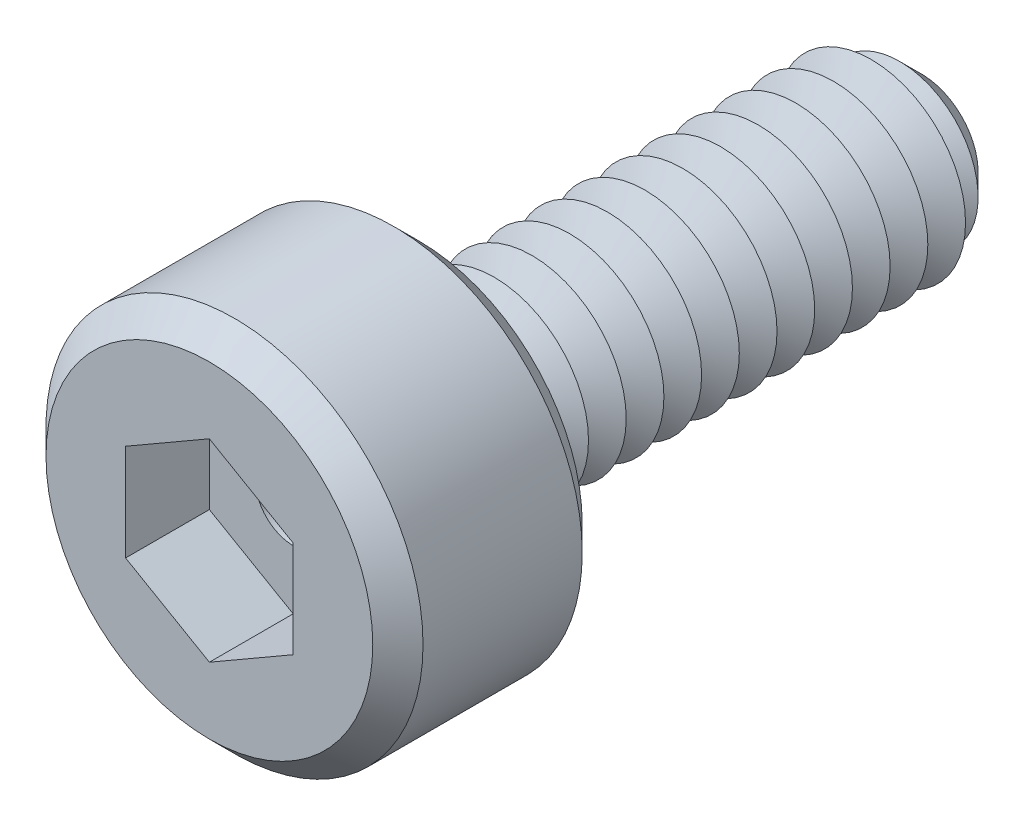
ISO-10303-21;
HEADER;
FILE_DESCRIPTION(('STEP AP214'),'2;1');
FILE_NAME('part.step','',(''),(''),'','','');
FILE_SCHEMA(('AUTOMOTIVE_DESIGN { 1 0 10303 214 1 1 1 1 }'));
ENDSEC;
DATA;
#1=APPLICATION_CONTEXT('core data for automotive mechanical design processes');
#2=APPLICATION_PROTOCOL_DEFINITION('international standard','automotive_design',2000,#1);
#3=PRODUCT_CONTEXT('',#1,'mechanical');
#4=PRODUCT('Part','Part','',(#3));
#5=PRODUCT_RELATED_PRODUCT_CATEGORY('part','',(#4));
#6=PRODUCT_DEFINITION_FORMATION('','',#4);
#7=PRODUCT_DEFINITION_CONTEXT('part definition',#1,'design');
#8=PRODUCT_DEFINITION('design','',#6,#7);
#9=PRODUCT_DEFINITION_SHAPE('','',#8);
#10=(LENGTH_UNIT() NAMED_UNIT(*) SI_UNIT(.MILLI.,.METRE.));
#11=(NAMED_UNIT(*) PLANE_ANGLE_UNIT() SI_UNIT($,.RADIAN.));
#12=(NAMED_UNIT(*) SI_UNIT($,.STERADIAN.) SOLID_ANGLE_UNIT());
#13=UNCERTAINTY_MEASURE_WITH_UNIT(LENGTH_MEASURE(1.E-05),#10,'distance_accuracy_value','');
#14=(GEOMETRIC_REPRESENTATION_CONTEXT(3) GLOBAL_UNCERTAINTY_ASSIGNED_CONTEXT((#13)) GLOBAL_UNIT_ASSIGNED_CONTEXT((#10,
#11,#12)) REPRESENTATION_CONTEXT('',''));
#15=CARTESIAN_POINT('',(0.,0.,0.));
#16=DIRECTION('',(0.,0.,1.));
#17=DIRECTION('',(1.,0.,0.));
#18=AXIS2_PLACEMENT_3D('',#15,#16,#17);
#19=CARTESIAN_POINT('',(0.,0.,2.5));
#20=DIRECTION('',(0.,0.,-1.));
#21=DIRECTION('',(-1.,0.,0.));
#22=AXIS2_PLACEMENT_3D('',#19,#20,#21);
#23=CYLINDRICAL_SURFACE('',#22,2.25);
#24=CARTESIAN_POINT('',(0.,0.,0.300000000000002));
#25=DIRECTION('',(0.,0.,1.));
#26=DIRECTION('',(1.,0.,0.));
#27=AXIS2_PLACEMENT_3D('',#24,#25,#26);
#28=CIRCLE('',#27,2.25);
#29=CARTESIAN_POINT('',(2.25,0.,0.300000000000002));
#30=VERTEX_POINT('',#29);
#31=EDGE_CURVE('E281',#30,#30,#28,.T.);
#32=ORIENTED_EDGE('',*,*,#31,.T.);
#33=EDGE_LOOP('',(#32));
#34=FACE_BOUND('',#33,.T.);
#35=CARTESIAN_POINT('',(0.,0.,2.2));
#36=DIRECTION('',(0.,0.,1.));
#37=DIRECTION('',(1.,0.,0.));
#38=AXIS2_PLACEMENT_3D('',#35,#36,#37);
#39=CIRCLE('',#38,2.25);
#40=CARTESIAN_POINT('',(2.25,0.,2.2));
#41=VERTEX_POINT('',#40);
#42=EDGE_CURVE('E274',#41,#41,#39,.F.);
#43=ORIENTED_EDGE('',*,*,#42,.T.);
#44=EDGE_LOOP('',(#43));
#45=FACE_BOUND('',#44,.T.);
#46=ADVANCED_FACE('F39',(#34,#45),#23,.T.);
#47=CARTESIAN_POINT('',(0.,0.,2.5));
#48=DIRECTION('',(0.,0.,1.));
#49=DIRECTION('',(1.,0.,0.));
#50=AXIS2_PLACEMENT_3D('',#47,#48,#49);
#51=PLANE('',#50);
#52=CARTESIAN_POINT('',(0.,0.,2.5));
#53=DIRECTION('',(0.,0.,1.));
#54=DIRECTION('',(1.,0.,0.));
#55=AXIS2_PLACEMENT_3D('',#52,#53,#54);
#56=CIRCLE('',#55,1.95);
#57=CARTESIAN_POINT('',(1.95,0.,2.5));
#58=VERTEX_POINT('',#57);
#59=EDGE_CURVE('E11',#58,#58,#56,.T.);
#60=ORIENTED_EDGE('',*,*,#59,.T.);
#61=EDGE_LOOP('',(#60));
#62=FACE_BOUND('',#61,.T.);
#63=DIRECTION('',(-0.866025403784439,0.5,0.));
#64=VECTOR('',#63,1.);
#65=CARTESIAN_POINT('',(0.999999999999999,0.577350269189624,2.5));
#66=LINE('',#65,#64);
#67=CARTESIAN_POINT('',(0.999999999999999,0.577350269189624,2.5));
#68=VERTEX_POINT('',#67);
#69=CARTESIAN_POINT('',(0.,1.15470053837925,2.5));
#70=VERTEX_POINT('',#69);
#71=EDGE_CURVE('E55',#68,#70,#66,.T.);
#72=ORIENTED_EDGE('',*,*,#71,.F.);
#73=DIRECTION('',(0.,1.,0.));
#74=VECTOR('',#73,1.);
#75=CARTESIAN_POINT('',(1.,-0.577350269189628,2.5));
#76=LINE('',#75,#74);
#77=CARTESIAN_POINT('',(1.,-0.577350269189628,2.5));
#78=VERTEX_POINT('',#77);
#79=EDGE_CURVE('E151',#78,#68,#76,.T.);
#80=ORIENTED_EDGE('',*,*,#79,.F.);
#81=DIRECTION('',(0.866025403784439,0.5,0.));
#82=VECTOR('',#81,1.);
#83=CARTESIAN_POINT('',(0.,-1.15470053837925,2.5));
#84=LINE('',#83,#82);
#85=CARTESIAN_POINT('',(0.,-1.15470053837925,2.5));
#86=VERTEX_POINT('',#85);
#87=EDGE_CURVE('E148',#86,#78,#84,.T.);
#88=ORIENTED_EDGE('',*,*,#87,.F.);
#89=DIRECTION('',(0.866025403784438,-0.5,0.));
#90=VECTOR('',#89,1.);
#91=CARTESIAN_POINT('',(-1.,-0.577350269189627,2.5));
#92=LINE('',#91,#90);
#93=CARTESIAN_POINT('',(-1.,-0.577350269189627,2.5));
#94=VERTEX_POINT('',#93);
#95=EDGE_CURVE('E103',#94,#86,#92,.T.);
#96=ORIENTED_EDGE('',*,*,#95,.F.);
#97=DIRECTION('',(0.,-1.,0.));
#98=VECTOR('',#97,1.);
#99=CARTESIAN_POINT('',(-1.,0.577350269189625,2.5));
#100=LINE('',#99,#98);
#101=CARTESIAN_POINT('',(-1.,0.577350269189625,2.5));
#102=VERTEX_POINT('',#101);
#103=EDGE_CURVE('E142',#102,#94,#100,.T.);
#104=ORIENTED_EDGE('',*,*,#103,.F.);
#105=DIRECTION('',(-0.866025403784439,-0.5,0.));
#106=VECTOR('',#105,1.);
#107=CARTESIAN_POINT('',(0.,1.15470053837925,2.5));
#108=LINE('',#107,#106);
#109=EDGE_CURVE('E137',#70,#102,#108,.T.);
#110=ORIENTED_EDGE('',*,*,#109,.F.);
#111=EDGE_LOOP('',(#72,#80,#88,#96,#104,#110));
#112=FACE_BOUND('',#111,.T.);
#113=ADVANCED_FACE('F298',(#62,#112),#51,.T.);
#114=CARTESIAN_POINT('',(0.,0.,0.));
#115=DIRECTION('',(0.,0.,1.));
#116=DIRECTION('',(1.,0.,0.));
#117=AXIS2_PLACEMENT_3D('',#114,#115,#116);
#118=PLANE('',#117);
#119=CARTESIAN_POINT('',(0.,0.,0.));
#120=DIRECTION('',(0.,0.,1.));
#121=DIRECTION('',(1.,0.,0.));
#122=AXIS2_PLACEMENT_3D('',#119,#120,#121);
#123=CIRCLE('',#122,1.95);
#124=CARTESIAN_POINT('',(1.95,0.,0.));
#125=VERTEX_POINT('',#124);
#126=EDGE_CURVE('E48',#125,#125,#123,.F.);
#127=ORIENTED_EDGE('',*,*,#126,.T.);
#128=EDGE_LOOP('',(#127));
#129=FACE_BOUND('',#128,.T.);
#130=CARTESIAN_POINT('',(0.,0.,0.));
#131=DIRECTION('',(0.,0.,1.));
#132=DIRECTION('',(1.,0.,0.));
#133=AXIS2_PLACEMENT_3D('',#130,#131,#132);
#134=CIRCLE('',#133,1.125);
#135=CARTESIAN_POINT('',(1.125,0.,0.));
#136=VERTEX_POINT('',#135);
#137=EDGE_CURVE('E266',#136,#136,#134,.T.);
#138=ORIENTED_EDGE('',*,*,#137,.T.);
#139=EDGE_LOOP('',(#138));
#140=FACE_BOUND('',#139,.T.);
#141=ADVANCED_FACE('F287',(#129,#140),#118,.F.);
#142=CARTESIAN_POINT('',(0.,0.,0.));
#143=DIRECTION('',(0.,0.,1.));
#144=DIRECTION('',(1.,0.,0.));
#145=AXIS2_PLACEMENT_3D('',#142,#143,#144);
#146=CONICAL_SURFACE('',#145,1.125,1.0471975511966);
#147=CARTESIAN_POINT('',(0.,0.,-0.225));
#148=DIRECTION('',(0.,0.,1.));
#149=DIRECTION('',(1.,0.,0.));
#150=AXIS2_PLACEMENT_3D('',#147,#148,#149);
#151=CIRCLE('',#150,0.735288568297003);
#152=CARTESIAN_POINT('',(0.735288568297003,0.,-0.225));
#153=VERTEX_POINT('',#152);
#154=EDGE_CURVE('E262',#153,#153,#151,.T.);
#155=ORIENTED_EDGE('',*,*,#154,.T.);
#156=EDGE_LOOP('',(#155));
#157=FACE_BOUND('',#156,.T.);
#158=ORIENTED_EDGE('',*,*,#137,.F.);
#159=EDGE_LOOP('',(#158));
#160=FACE_BOUND('',#159,.T.);
#161=ADVANCED_FACE('F452',(#157,#160),#146,.T.);
#162=CARTESIAN_POINT('',(0.,0.,-0.225));
#163=DIRECTION('',(0.,0.,-1.));
#164=DIRECTION('',(-1.,0.,0.));
#165=AXIS2_PLACEMENT_3D('',#162,#163,#164);
#166=CONICAL_SURFACE('',#165,0.735288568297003,1.0471975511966);
#167=CARTESIAN_POINT('',(0.,0.,-0.45));
#168=DIRECTION('',(0.,0.,1.));
#169=DIRECTION('',(1.,0.,0.));
#170=AXIS2_PLACEMENT_3D('',#167,#168,#169);
#171=CIRCLE('',#170,1.125);
#172=CARTESIAN_POINT('',(1.125,0.,-0.45));
#173=VERTEX_POINT('',#172);
#174=EDGE_CURVE('E258',#173,#173,#171,.T.);
#175=ORIENTED_EDGE('',*,*,#174,.T.);
#176=EDGE_LOOP('',(#175));
#177=FACE_BOUND('',#176,.T.);
#178=ORIENTED_EDGE('',*,*,#154,.F.);
#179=EDGE_LOOP('',(#178));
#180=FACE_BOUND('',#179,.T.);
#181=ADVANCED_FACE('F448',(#177,#180),#166,.T.);
#182=CARTESIAN_POINT('',(0.,0.,-0.45));
#183=DIRECTION('',(0.,0.,1.));
#184=DIRECTION('',(1.,0.,0.));
#185=AXIS2_PLACEMENT_3D('',#182,#183,#184);
#186=CONICAL_SURFACE('',#185,1.125,1.0471975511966);
#187=CARTESIAN_POINT('',(0.,0.,-0.675));
#188=DIRECTION('',(0.,0.,1.));
#189=DIRECTION('',(1.,0.,0.));
#190=AXIS2_PLACEMENT_3D('',#187,#188,#189);
#191=CIRCLE('',#190,0.735288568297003);
#192=CARTESIAN_POINT('',(0.735288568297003,0.,-0.675));
#193=VERTEX_POINT('',#192);
#194=EDGE_CURVE('E254',#193,#193,#191,.T.);
#195=ORIENTED_EDGE('',*,*,#194,.T.);
#196=EDGE_LOOP('',(#195));
#197=FACE_BOUND('',#196,.T.);
#198=ORIENTED_EDGE('',*,*,#174,.F.);
#199=EDGE_LOOP('',(#198));
#200=FACE_BOUND('',#199,.T.);
#201=ADVANCED_FACE('F444',(#197,#200),#186,.T.);
#202=CARTESIAN_POINT('',(0.,0.,-0.675));
#203=DIRECTION('',(0.,0.,-1.));
#204=DIRECTION('',(-1.,0.,0.));
#205=AXIS2_PLACEMENT_3D('',#202,#203,#204);
#206=CONICAL_SURFACE('',#205,0.735288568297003,1.0471975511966);
#207=CARTESIAN_POINT('',(0.,0.,-0.9));
#208=DIRECTION('',(0.,0.,1.));
#209=DIRECTION('',(1.,0.,0.));
#210=AXIS2_PLACEMENT_3D('',#207,#208,#209);
#211=CIRCLE('',#210,1.125);
#212=CARTESIAN_POINT('',(1.125,0.,-0.9));
#213=VERTEX_POINT('',#212);
#214=EDGE_CURVE('E250',#213,#213,#211,.T.);
#215=ORIENTED_EDGE('',*,*,#214,.T.);
#216=EDGE_LOOP('',(#215));
#217=FACE_BOUND('',#216,.T.);
#218=ORIENTED_EDGE('',*,*,#194,.F.);
#219=EDGE_LOOP('',(#218));
#220=FACE_BOUND('',#219,.T.);
#221=ADVANCED_FACE('F440',(#217,#220),#206,.T.);
#222=CARTESIAN_POINT('',(0.,0.,-0.9));
#223=DIRECTION('',(0.,0.,1.));
#224=DIRECTION('',(1.,0.,0.));
#225=AXIS2_PLACEMENT_3D('',#222,#223,#224);
#226=CONICAL_SURFACE('',#225,1.125,1.0471975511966);
#227=CARTESIAN_POINT('',(0.,0.,-1.125));
#228=DIRECTION('',(0.,0.,1.));
#229=DIRECTION('',(1.,0.,0.));
#230=AXIS2_PLACEMENT_3D('',#227,#228,#229);
#231=CIRCLE('',#230,0.735288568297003);
#232=CARTESIAN_POINT('',(0.735288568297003,0.,-1.125));
#233=VERTEX_POINT('',#232);
#234=EDGE_CURVE('E246',#233,#233,#231,.T.);
#235=ORIENTED_EDGE('',*,*,#234,.T.);
#236=EDGE_LOOP('',(#235));
#237=FACE_BOUND('',#236,.T.);
#238=ORIENTED_EDGE('',*,*,#214,.F.);
#239=EDGE_LOOP('',(#238));
#240=FACE_BOUND('',#239,.T.);
#241=ADVANCED_FACE('F436',(#237,#240),#226,.T.);
#242=CARTESIAN_POINT('',(0.,0.,-1.125));
#243=DIRECTION('',(0.,0.,-1.));
#244=DIRECTION('',(-1.,0.,0.));
#245=AXIS2_PLACEMENT_3D('',#242,#243,#244);
#246=CONICAL_SURFACE('',#245,0.735288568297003,1.0471975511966);
#247=CARTESIAN_POINT('',(0.,0.,-1.35));
#248=DIRECTION('',(0.,0.,1.));
#249=DIRECTION('',(1.,0.,0.));
#250=AXIS2_PLACEMENT_3D('',#247,#248,#249);
#251=CIRCLE('',#250,1.125);
#252=CARTESIAN_POINT('',(1.125,0.,-1.35));
#253=VERTEX_POINT('',#252);
#254=EDGE_CURVE('E242',#253,#253,#251,.T.);
#255=ORIENTED_EDGE('',*,*,#254,.T.);
#256=EDGE_LOOP('',(#255));
#257=FACE_BOUND('',#256,.T.);
#258=ORIENTED_EDGE('',*,*,#234,.F.);
#259=EDGE_LOOP('',(#258));
#260=FACE_BOUND('',#259,.T.);
#261=ADVANCED_FACE('F432',(#257,#260),#246,.T.);
#262=CARTESIAN_POINT('',(0.,0.,-1.35));
#263=DIRECTION('',(0.,0.,1.));
#264=DIRECTION('',(1.,0.,0.));
#265=AXIS2_PLACEMENT_3D('',#262,#263,#264);
#266=CONICAL_SURFACE('',#265,1.125,1.0471975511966);
#267=CARTESIAN_POINT('',(0.,0.,-1.575));
#268=DIRECTION('',(0.,0.,1.));
#269=DIRECTION('',(1.,0.,0.));
#270=AXIS2_PLACEMENT_3D('',#267,#268,#269);
#271=CIRCLE('',#270,0.735288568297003);
#272=CARTESIAN_POINT('',(0.735288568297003,0.,-1.575));
#273=VERTEX_POINT('',#272);
#274=EDGE_CURVE('E238',#273,#273,#271,.T.);
#275=ORIENTED_EDGE('',*,*,#274,.T.);
#276=EDGE_LOOP('',(#275));
#277=FACE_BOUND('',#276,.T.);
#278=ORIENTED_EDGE('',*,*,#254,.F.);
#279=EDGE_LOOP('',(#278));
#280=FACE_BOUND('',#279,.T.);
#281=ADVANCED_FACE('F428',(#277,#280),#266,.T.);
#282=CARTESIAN_POINT('',(0.,0.,-1.575));
#283=DIRECTION('',(0.,0.,-1.));
#284=DIRECTION('',(-1.,0.,0.));
#285=AXIS2_PLACEMENT_3D('',#282,#283,#284);
#286=CONICAL_SURFACE('',#285,0.735288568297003,1.0471975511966);
#287=CARTESIAN_POINT('',(0.,0.,-1.8));
#288=DIRECTION('',(0.,0.,1.));
#289=DIRECTION('',(1.,0.,0.));
#290=AXIS2_PLACEMENT_3D('',#287,#288,#289);
#291=CIRCLE('',#290,1.125);
#292=CARTESIAN_POINT('',(1.125,0.,-1.8));
#293=VERTEX_POINT('',#292);
#294=EDGE_CURVE('E234',#293,#293,#291,.T.);
#295=ORIENTED_EDGE('',*,*,#294,.T.);
#296=EDGE_LOOP('',(#295));
#297=FACE_BOUND('',#296,.T.);
#298=ORIENTED_EDGE('',*,*,#274,.F.);
#299=EDGE_LOOP('',(#298));
#300=FACE_BOUND('',#299,.T.);
#301=ADVANCED_FACE('F424',(#297,#300),#286,.T.);
#302=CARTESIAN_POINT('',(0.,0.,-1.8));
#303=DIRECTION('',(0.,0.,1.));
#304=DIRECTION('',(1.,0.,0.));
#305=AXIS2_PLACEMENT_3D('',#302,#303,#304);
#306=CONICAL_SURFACE('',#305,1.125,1.0471975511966);
#307=CARTESIAN_POINT('',(0.,0.,-2.025));
#308=DIRECTION('',(0.,0.,1.));
#309=DIRECTION('',(1.,0.,0.));
#310=AXIS2_PLACEMENT_3D('',#307,#308,#309);
#311=CIRCLE('',#310,0.735288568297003);
#312=CARTESIAN_POINT('',(0.735288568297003,0.,-2.025));
#313=VERTEX_POINT('',#312);
#314=EDGE_CURVE('E230',#313,#313,#311,.T.);
#315=ORIENTED_EDGE('',*,*,#314,.T.);
#316=EDGE_LOOP('',(#315));
#317=FACE_BOUND('',#316,.T.);
#318=ORIENTED_EDGE('',*,*,#294,.F.);
#319=EDGE_LOOP('',(#318));
#320=FACE_BOUND('',#319,.T.);
#321=ADVANCED_FACE('F420',(#317,#320),#306,.T.);
#322=CARTESIAN_POINT('',(0.,0.,-2.025));
#323=DIRECTION('',(0.,0.,-1.));
#324=DIRECTION('',(-1.,0.,0.));
#325=AXIS2_PLACEMENT_3D('',#322,#323,#324);
#326=CONICAL_SURFACE('',#325,0.735288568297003,1.0471975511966);
#327=CARTESIAN_POINT('',(0.,0.,-2.25));
#328=DIRECTION('',(0.,0.,1.));
#329=DIRECTION('',(1.,0.,0.));
#330=AXIS2_PLACEMENT_3D('',#327,#328,#329);
#331=CIRCLE('',#330,1.125);
#332=CARTESIAN_POINT('',(1.125,0.,-2.25));
#333=VERTEX_POINT('',#332);
#334=EDGE_CURVE('E226',#333,#333,#331,.T.);
#335=ORIENTED_EDGE('',*,*,#334,.T.);
#336=EDGE_LOOP('',(#335));
#337=FACE_BOUND('',#336,.T.);
#338=ORIENTED_EDGE('',*,*,#314,.F.);
#339=EDGE_LOOP('',(#338));
#340=FACE_BOUND('',#339,.T.);
#341=ADVANCED_FACE('F416',(#337,#340),#326,.T.);
#342=CARTESIAN_POINT('',(0.,0.,-2.25));
#343=DIRECTION('',(0.,0.,1.));
#344=DIRECTION('',(1.,0.,0.));
#345=AXIS2_PLACEMENT_3D('',#342,#343,#344);
#346=CONICAL_SURFACE('',#345,1.125,1.0471975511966);
#347=CARTESIAN_POINT('',(0.,0.,-2.475));
#348=DIRECTION('',(0.,0.,1.));
#349=DIRECTION('',(1.,0.,0.));
#350=AXIS2_PLACEMENT_3D('',#347,#348,#349);
#351=CIRCLE('',#350,0.735288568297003);
#352=CARTESIAN_POINT('',(0.735288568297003,0.,-2.475));
#353=VERTEX_POINT('',#352);
#354=EDGE_CURVE('E222',#353,#353,#351,.T.);
#355=ORIENTED_EDGE('',*,*,#354,.T.);
#356=EDGE_LOOP('',(#355));
#357=FACE_BOUND('',#356,.T.);
#358=ORIENTED_EDGE('',*,*,#334,.F.);
#359=EDGE_LOOP('',(#358));
#360=FACE_BOUND('',#359,.T.);
#361=ADVANCED_FACE('F412',(#357,#360),#346,.T.);
#362=CARTESIAN_POINT('',(0.,0.,-2.475));
#363=DIRECTION('',(0.,0.,-1.));
#364=DIRECTION('',(-1.,0.,0.));
#365=AXIS2_PLACEMENT_3D('',#362,#363,#364);
#366=CONICAL_SURFACE('',#365,0.735288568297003,1.0471975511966);
#367=CARTESIAN_POINT('',(0.,0.,-2.7));
#368=DIRECTION('',(0.,0.,1.));
#369=DIRECTION('',(1.,0.,0.));
#370=AXIS2_PLACEMENT_3D('',#367,#368,#369);
#371=CIRCLE('',#370,1.125);
#372=CARTESIAN_POINT('',(1.125,0.,-2.7));
#373=VERTEX_POINT('',#372);
#374=EDGE_CURVE('E218',#373,#373,#371,.T.);
#375=ORIENTED_EDGE('',*,*,#374,.T.);
#376=EDGE_LOOP('',(#375));
#377=FACE_BOUND('',#376,.T.);
#378=ORIENTED_EDGE('',*,*,#354,.F.);
#379=EDGE_LOOP('',(#378));
#380=FACE_BOUND('',#379,.T.);
#381=ADVANCED_FACE('F408',(#377,#380),#366,.T.);
#382=CARTESIAN_POINT('',(0.,0.,-2.7));
#383=DIRECTION('',(0.,0.,1.));
#384=DIRECTION('',(1.,0.,0.));
#385=AXIS2_PLACEMENT_3D('',#382,#383,#384);
#386=CONICAL_SURFACE('',#385,1.125,1.0471975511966);
#387=CARTESIAN_POINT('',(0.,0.,-2.925));
#388=DIRECTION('',(0.,0.,1.));
#389=DIRECTION('',(1.,0.,0.));
#390=AXIS2_PLACEMENT_3D('',#387,#388,#389);
#391=CIRCLE('',#390,0.735288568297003);
#392=CARTESIAN_POINT('',(0.735288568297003,0.,-2.925));
#393=VERTEX_POINT('',#392);
#394=EDGE_CURVE('E214',#393,#393,#391,.T.);
#395=ORIENTED_EDGE('',*,*,#394,.T.);
#396=EDGE_LOOP('',(#395));
#397=FACE_BOUND('',#396,.T.);
#398=ORIENTED_EDGE('',*,*,#374,.F.);
#399=EDGE_LOOP('',(#398));
#400=FACE_BOUND('',#399,.T.);
#401=ADVANCED_FACE('F404',(#397,#400),#386,.T.);
#402=CARTESIAN_POINT('',(0.,0.,-2.925));
#403=DIRECTION('',(0.,0.,-1.));
#404=DIRECTION('',(-1.,0.,0.));
#405=AXIS2_PLACEMENT_3D('',#402,#403,#404);
#406=CONICAL_SURFACE('',#405,0.735288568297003,1.0471975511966);
#407=CARTESIAN_POINT('',(0.,0.,-3.15));
#408=DIRECTION('',(0.,0.,1.));
#409=DIRECTION('',(1.,0.,0.));
#410=AXIS2_PLACEMENT_3D('',#407,#408,#409);
#411=CIRCLE('',#410,1.125);
#412=CARTESIAN_POINT('',(1.125,0.,-3.15));
#413=VERTEX_POINT('',#412);
#414=EDGE_CURVE('E210',#413,#413,#411,.T.);
#415=ORIENTED_EDGE('',*,*,#414,.T.);
#416=EDGE_LOOP('',(#415));
#417=FACE_BOUND('',#416,.T.);
#418=ORIENTED_EDGE('',*,*,#394,.F.);
#419=EDGE_LOOP('',(#418));
#420=FACE_BOUND('',#419,.T.);
#421=ADVANCED_FACE('F400',(#417,#420),#406,.T.);
#422=CARTESIAN_POINT('',(0.,0.,-3.15));
#423=DIRECTION('',(0.,0.,1.));
#424=DIRECTION('',(1.,0.,0.));
#425=AXIS2_PLACEMENT_3D('',#422,#423,#424);
#426=CONICAL_SURFACE('',#425,1.125,1.0471975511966);
#427=CARTESIAN_POINT('',(0.,0.,-3.375));
#428=DIRECTION('',(0.,0.,1.));
#429=DIRECTION('',(1.,0.,0.));
#430=AXIS2_PLACEMENT_3D('',#427,#428,#429);
#431=CIRCLE('',#430,0.735288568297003);
#432=CARTESIAN_POINT('',(0.735288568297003,0.,-3.375));
#433=VERTEX_POINT('',#432);
#434=EDGE_CURVE('E206',#433,#433,#431,.T.);
#435=ORIENTED_EDGE('',*,*,#434,.T.);
#436=EDGE_LOOP('',(#435));
#437=FACE_BOUND('',#436,.T.);
#438=ORIENTED_EDGE('',*,*,#414,.F.);
#439=EDGE_LOOP('',(#438));
#440=FACE_BOUND('',#439,.T.);
#441=ADVANCED_FACE('F396',(#437,#440),#426,.T.);
#442=CARTESIAN_POINT('',(0.,0.,-3.375));
#443=DIRECTION('',(0.,0.,-1.));
#444=DIRECTION('',(-1.,0.,0.));
#445=AXIS2_PLACEMENT_3D('',#442,#443,#444);
#446=CONICAL_SURFACE('',#445,0.735288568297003,1.0471975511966);
#447=CARTESIAN_POINT('',(0.,0.,-3.6));
#448=DIRECTION('',(0.,0.,1.));
#449=DIRECTION('',(1.,0.,0.));
#450=AXIS2_PLACEMENT_3D('',#447,#448,#449);
#451=CIRCLE('',#450,1.125);
#452=CARTESIAN_POINT('',(1.125,0.,-3.6));
#453=VERTEX_POINT('',#452);
#454=EDGE_CURVE('E202',#453,#453,#451,.T.);
#455=ORIENTED_EDGE('',*,*,#454,.T.);
#456=EDGE_LOOP('',(#455));
#457=FACE_BOUND('',#456,.T.);
#458=ORIENTED_EDGE('',*,*,#434,.F.);
#459=EDGE_LOOP('',(#458));
#460=FACE_BOUND('',#459,.T.);
#461=ADVANCED_FACE('F392',(#457,#460),#446,.T.);
#462=CARTESIAN_POINT('',(0.,0.,-3.6));
#463=DIRECTION('',(0.,0.,1.));
#464=DIRECTION('',(1.,0.,0.));
#465=AXIS2_PLACEMENT_3D('',#462,#463,#464);
#466=CONICAL_SURFACE('',#465,1.125,1.0471975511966);
#467=CARTESIAN_POINT('',(0.,0.,-3.825));
#468=DIRECTION('',(0.,0.,1.));
#469=DIRECTION('',(1.,0.,0.));
#470=AXIS2_PLACEMENT_3D('',#467,#468,#469);
#471=CIRCLE('',#470,0.735288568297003);
#472=CARTESIAN_POINT('',(0.735288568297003,0.,-3.825));
#473=VERTEX_POINT('',#472);
#474=EDGE_CURVE('E198',#473,#473,#471,.T.);
#475=ORIENTED_EDGE('',*,*,#474,.T.);
#476=EDGE_LOOP('',(#475));
#477=FACE_BOUND('',#476,.T.);
#478=ORIENTED_EDGE('',*,*,#454,.F.);
#479=EDGE_LOOP('',(#478));
#480=FACE_BOUND('',#479,.T.);
#481=ADVANCED_FACE('F388',(#477,#480),#466,.T.);
#482=CARTESIAN_POINT('',(0.,0.,-3.825));
#483=DIRECTION('',(0.,0.,-1.));
#484=DIRECTION('',(-1.,0.,0.));
#485=AXIS2_PLACEMENT_3D('',#482,#483,#484);
#486=CONICAL_SURFACE('',#485,0.735288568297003,1.0471975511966);
#487=CARTESIAN_POINT('',(0.,0.,-4.05));
#488=DIRECTION('',(0.,0.,1.));
#489=DIRECTION('',(1.,0.,0.));
#490=AXIS2_PLACEMENT_3D('',#487,#488,#489);
#491=CIRCLE('',#490,1.125);
#492=CARTESIAN_POINT('',(1.125,0.,-4.05));
#493=VERTEX_POINT('',#492);
#494=EDGE_CURVE('E194',#493,#493,#491,.T.);
#495=ORIENTED_EDGE('',*,*,#494,.T.);
#496=EDGE_LOOP('',(#495));
#497=FACE_BOUND('',#496,.T.);
#498=ORIENTED_EDGE('',*,*,#474,.F.);
#499=EDGE_LOOP('',(#498));
#500=FACE_BOUND('',#499,.T.);
#501=ADVANCED_FACE('F384',(#497,#500),#486,.T.);
#502=CARTESIAN_POINT('',(0.,0.,-4.05));
#503=DIRECTION('',(0.,0.,1.));
#504=DIRECTION('',(1.,0.,0.));
#505=AXIS2_PLACEMENT_3D('',#502,#503,#504);
#506=CONICAL_SURFACE('',#505,1.125,1.0471975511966);
#507=CARTESIAN_POINT('',(0.,0.,-4.275));
#508=DIRECTION('',(0.,0.,1.));
#509=DIRECTION('',(1.,0.,0.));
#510=AXIS2_PLACEMENT_3D('',#507,#508,#509);
#511=CIRCLE('',#510,0.735288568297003);
#512=CARTESIAN_POINT('',(0.735288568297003,0.,-4.275));
#513=VERTEX_POINT('',#512);
#514=EDGE_CURVE('E190',#513,#513,#511,.T.);
#515=ORIENTED_EDGE('',*,*,#514,.T.);
#516=EDGE_LOOP('',(#515));
#517=FACE_BOUND('',#516,.T.);
#518=ORIENTED_EDGE('',*,*,#494,.F.);
#519=EDGE_LOOP('',(#518));
#520=FACE_BOUND('',#519,.T.);
#521=ADVANCED_FACE('F380',(#517,#520),#506,.T.);
#522=CARTESIAN_POINT('',(0.,0.,-4.275));
#523=DIRECTION('',(0.,0.,-1.));
#524=DIRECTION('',(-1.,0.,0.));
#525=AXIS2_PLACEMENT_3D('',#522,#523,#524);
#526=CONICAL_SURFACE('',#525,0.735288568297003,1.0471975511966);
#527=CARTESIAN_POINT('',(0.,0.,-4.5));
#528=DIRECTION('',(0.,0.,1.));
#529=DIRECTION('',(1.,0.,0.));
#530=AXIS2_PLACEMENT_3D('',#527,#528,#529);
#531=CIRCLE('',#530,1.125);
#532=CARTESIAN_POINT('',(1.125,0.,-4.5));
#533=VERTEX_POINT('',#532);
#534=EDGE_CURVE('E187',#533,#533,#531,.T.);
#535=ORIENTED_EDGE('',*,*,#534,.T.);
#536=EDGE_LOOP('',(#535));
#537=FACE_BOUND('',#536,.T.);
#538=ORIENTED_EDGE('',*,*,#514,.F.);
#539=EDGE_LOOP('',(#538));
#540=FACE_BOUND('',#539,.T.);
#541=ADVANCED_FACE('F376',(#537,#540),#526,.T.);
#542=CARTESIAN_POINT('',(0.,0.,-4.5));
#543=DIRECTION('',(0.,0.,1.));
#544=DIRECTION('',(1.,0.,0.));
#545=AXIS2_PLACEMENT_3D('',#542,#543,#544);
#546=CONICAL_SURFACE('',#545,1.125,1.0471975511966);
#547=CARTESIAN_POINT('',(0.,0.,-4.725));
#548=DIRECTION('',(0.,0.,1.));
#549=DIRECTION('',(1.,0.,0.));
#550=AXIS2_PLACEMENT_3D('',#547,#548,#549);
#551=CIRCLE('',#550,0.735288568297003);
#552=CARTESIAN_POINT('',(0.735288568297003,0.,-4.725));
#553=VERTEX_POINT('',#552);
#554=EDGE_CURVE('E183',#553,#553,#551,.T.);
#555=ORIENTED_EDGE('',*,*,#554,.T.);
#556=EDGE_LOOP('',(#555));
#557=FACE_BOUND('',#556,.T.);
#558=ORIENTED_EDGE('',*,*,#534,.F.);
#559=EDGE_LOOP('',(#558));
#560=FACE_BOUND('',#559,.T.);
#561=ADVANCED_FACE('F372',(#557,#560),#546,.T.);
#562=CARTESIAN_POINT('',(0.,0.,-4.725));
#563=DIRECTION('',(0.,0.,-1.));
#564=DIRECTION('',(-1.,0.,0.));
#565=AXIS2_PLACEMENT_3D('',#562,#563,#564);
#566=CONICAL_SURFACE('',#565,0.735288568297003,1.0471975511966);
#567=CARTESIAN_POINT('',(0.,0.,-4.95));
#568=DIRECTION('',(0.,0.,1.));
#569=DIRECTION('',(1.,0.,0.));
#570=AXIS2_PLACEMENT_3D('',#567,#568,#569);
#571=CIRCLE('',#570,1.125);
#572=CARTESIAN_POINT('',(1.125,0.,-4.95));
#573=VERTEX_POINT('',#572);
#574=EDGE_CURVE('E179',#573,#573,#571,.T.);
#575=ORIENTED_EDGE('',*,*,#574,.T.);
#576=EDGE_LOOP('',(#575));
#577=FACE_BOUND('',#576,.T.);
#578=ORIENTED_EDGE('',*,*,#554,.F.);
#579=EDGE_LOOP('',(#578));
#580=FACE_BOUND('',#579,.T.);
#581=ADVANCED_FACE('F368',(#577,#580),#566,.T.);
#582=CARTESIAN_POINT('',(0.,0.,-4.95));
#583=DIRECTION('',(0.,0.,1.));
#584=DIRECTION('',(1.,0.,0.));
#585=AXIS2_PLACEMENT_3D('',#582,#583,#584);
#586=CONICAL_SURFACE('',#585,1.125,1.0471975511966);
#587=CARTESIAN_POINT('',(0.,0.,-5.175));
#588=DIRECTION('',(0.,0.,1.));
#589=DIRECTION('',(1.,0.,0.));
#590=AXIS2_PLACEMENT_3D('',#587,#588,#589);
#591=CIRCLE('',#590,0.735288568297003);
#592=CARTESIAN_POINT('',(0.735288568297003,0.,-5.175));
#593=VERTEX_POINT('',#592);
#594=EDGE_CURVE('E175',#593,#593,#591,.T.);
#595=ORIENTED_EDGE('',*,*,#594,.T.);
#596=EDGE_LOOP('',(#595));
#597=FACE_BOUND('',#596,.T.);
#598=ORIENTED_EDGE('',*,*,#574,.F.);
#599=EDGE_LOOP('',(#598));
#600=FACE_BOUND('',#599,.T.);
#601=ADVANCED_FACE('F364',(#597,#600),#586,.T.);
#602=CARTESIAN_POINT('',(0.,0.,-5.175));
#603=DIRECTION('',(0.,0.,-1.));
#604=DIRECTION('',(-1.,0.,0.));
#605=AXIS2_PLACEMENT_3D('',#602,#603,#604);
#606=CONICAL_SURFACE('',#605,0.735288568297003,1.0471975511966);
#607=CARTESIAN_POINT('',(0.,0.,-5.4));
#608=DIRECTION('',(0.,0.,1.));
#609=DIRECTION('',(1.,0.,0.));
#610=AXIS2_PLACEMENT_3D('',#607,#608,#609);
#611=CIRCLE('',#610,1.125);
#612=CARTESIAN_POINT('',(1.125,0.,-5.4));
#613=VERTEX_POINT('',#612);
#614=EDGE_CURVE('E170',#613,#613,#611,.T.);
#615=ORIENTED_EDGE('',*,*,#614,.T.);
#616=EDGE_LOOP('',(#615));
#617=FACE_BOUND('',#616,.T.);
#618=ORIENTED_EDGE('',*,*,#594,.F.);
#619=EDGE_LOOP('',(#618));
#620=FACE_BOUND('',#619,.T.);
#621=ADVANCED_FACE('F360',(#617,#620),#606,.T.);
#622=CARTESIAN_POINT('',(0.,0.,-5.4));
#623=DIRECTION('',(0.,0.,1.));
#624=DIRECTION('',(1.,0.,0.));
#625=AXIS2_PLACEMENT_3D('',#622,#623,#624);
#626=CONICAL_SURFACE('',#625,1.125,1.0471975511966);
#627=CARTESIAN_POINT('',(0.,0.,-5.625));
#628=DIRECTION('',(0.,0.,1.));
#629=DIRECTION('',(1.,0.,0.));
#630=AXIS2_PLACEMENT_3D('',#627,#628,#629);
#631=CIRCLE('',#630,0.735288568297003);
#632=CARTESIAN_POINT('',(0.735288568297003,0.,-5.625));
#633=VERTEX_POINT('',#632);
#634=EDGE_CURVE('E157',#633,#633,#631,.T.);
#635=ORIENTED_EDGE('',*,*,#634,.T.);
#636=EDGE_LOOP('',(#635));
#637=FACE_BOUND('',#636,.T.);
#638=ORIENTED_EDGE('',*,*,#614,.F.);
#639=EDGE_LOOP('',(#638));
#640=FACE_BOUND('',#639,.T.);
#641=ADVANCED_FACE('F356',(#637,#640),#626,.T.);
#642=CARTESIAN_POINT('',(0.,0.,-5.625));
#643=DIRECTION('',(0.,0.,-1.));
#644=DIRECTION('',(-1.,0.,0.));
#645=AXIS2_PLACEMENT_3D('',#642,#643,#644);
#646=CONICAL_SURFACE('',#645,0.735288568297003,1.0471975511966);
#647=CARTESIAN_POINT('',(0.,0.,-5.74019237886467));
#648=DIRECTION('',(0.,0.,-1.));
#649=DIRECTION('',(-1.,0.,0.));
#650=AXIS2_PLACEMENT_3D('',#647,#648,#649);
#651=CIRCLE('',#650,0.934807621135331);
#652=CARTESIAN_POINT('',(-0.934807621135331,0.,-5.74019237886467));
#653=VERTEX_POINT('',#652);
#654=EDGE_CURVE('E174',#653,#653,#651,.T.);
#655=ORIENTED_EDGE('',*,*,#654,.F.);
#656=EDGE_LOOP('',(#655));
#657=FACE_BOUND('',#656,.T.);
#658=ORIENTED_EDGE('',*,*,#634,.F.);
#659=EDGE_LOOP('',(#658));
#660=FACE_BOUND('',#659,.T.);
#661=ADVANCED_FACE('F352',(#657,#660),#646,.T.);
#662=CARTESIAN_POINT('',(0.,0.,-6.));
#663=DIRECTION('',(0.,0.,-1.));
#664=DIRECTION('',(-1.,0.,0.));
#665=AXIS2_PLACEMENT_3D('',#662,#663,#664);
#666=PLANE('',#665);
#667=CARTESIAN_POINT('',(0.,0.,-6.));
#668=DIRECTION('',(0.,0.,-1.));
#669=DIRECTION('',(-1.,0.,0.));
#670=AXIS2_PLACEMENT_3D('',#667,#668,#669);
#671=CIRCLE('',#670,0.45);
#672=CARTESIAN_POINT('',(-0.45,0.,-6.));
#673=VERTEX_POINT('',#672);
#674=EDGE_CURVE('E138',#673,#673,#671,.F.);
#675=ORIENTED_EDGE('',*,*,#674,.T.);
#676=EDGE_LOOP('',(#675));
#677=FACE_BOUND('',#676,.T.);
#678=CARTESIAN_POINT('',(0.,0.,-6.));
#679=DIRECTION('',(0.,0.,-1.));
#680=DIRECTION('',(-1.,0.,0.));
#681=AXIS2_PLACEMENT_3D('',#678,#679,#680);
#682=CIRCLE('',#681,0.675);
#683=CARTESIAN_POINT('',(-0.675,0.,-6.));
#684=VERTEX_POINT('',#683);
#685=EDGE_CURVE('E270',#684,#684,#682,.T.);
#686=ORIENTED_EDGE('',*,*,#685,.T.);
#687=EDGE_LOOP('',(#686));
#688=FACE_BOUND('',#687,.T.);
#689=ADVANCED_FACE('F355',(#677,#688),#666,.T.);
#690=CARTESIAN_POINT('',(0.,0.,-6.));
#691=DIRECTION('',(0.,0.,1.));
#692=DIRECTION('',(1.,0.,0.));
#693=AXIS2_PLACEMENT_3D('',#690,#691,#692);
#694=CONICAL_SURFACE('',#693,0.675,0.785398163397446);
#695=ORIENTED_EDGE('',*,*,#685,.F.);
#696=EDGE_LOOP('',(#695));
#697=FACE_BOUND('',#696,.T.);
#698=ORIENTED_EDGE('',*,*,#654,.T.);
#699=EDGE_LOOP('',(#698));
#700=FACE_BOUND('',#699,.T.);
#701=ADVANCED_FACE('F351',(#697,#700),#694,.T.);
#702=CARTESIAN_POINT('',(0.999999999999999,0.577350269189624,1.5));
#703=DIRECTION('',(0.5,0.866025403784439,0.));
#704=DIRECTION('',(-0.866025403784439,0.5,0.));
#705=AXIS2_PLACEMENT_3D('',#702,#703,#704);
#706=PLANE('',#705);
#707=ORIENTED_EDGE('',*,*,#71,.T.);
#708=DIRECTION('',(0.,0.,1.));
#709=VECTOR('',#708,1.);
#710=CARTESIAN_POINT('',(0.,1.15470053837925,1.5));
#711=LINE('',#710,#709);
#712=CARTESIAN_POINT('',(0.,1.15470053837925,1.5));
#713=VERTEX_POINT('',#712);
#714=EDGE_CURVE('E85',#713,#70,#711,.T.);
#715=ORIENTED_EDGE('',*,*,#714,.F.);
#716=DIRECTION('',(-0.866025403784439,0.5,0.));
#717=VECTOR('',#716,1.);
#718=CARTESIAN_POINT('',(0.999999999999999,0.577350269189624,1.5));
#719=LINE('',#718,#717);
#720=CARTESIAN_POINT('',(0.999999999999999,0.577350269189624,1.5));
#721=VERTEX_POINT('',#720);
#722=EDGE_CURVE('E154',#721,#713,#719,.T.);
#723=ORIENTED_EDGE('',*,*,#722,.F.);
#724=DIRECTION('',(0.,0.,1.));
#725=VECTOR('',#724,1.);
#726=CARTESIAN_POINT('',(0.999999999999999,0.577350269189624,1.5));
#727=LINE('',#726,#725);
#728=EDGE_CURVE('E63',#721,#68,#727,.T.);
#729=ORIENTED_EDGE('',*,*,#728,.T.);
#730=EDGE_LOOP('',(#707,#715,#723,#729));
#731=FACE_BOUND('',#730,.T.);
#732=ADVANCED_FACE('F341',(#731),#706,.F.);
#733=CARTESIAN_POINT('',(1.,-0.577350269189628,1.5));
#734=DIRECTION('',(1.,0.,0.));
#735=DIRECTION('',(0.,1.,0.));
#736=AXIS2_PLACEMENT_3D('',#733,#734,#735);
#737=PLANE('',#736);
#738=ORIENTED_EDGE('',*,*,#79,.T.);
#739=ORIENTED_EDGE('',*,*,#728,.F.);
#740=DIRECTION('',(0.,1.,0.));
#741=VECTOR('',#740,1.);
#742=CARTESIAN_POINT('',(1.,-0.577350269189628,1.5));
#743=LINE('',#742,#741);
#744=CARTESIAN_POINT('',(1.,-0.577350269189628,1.5));
#745=VERTEX_POINT('',#744);
#746=EDGE_CURVE('E117',#745,#721,#743,.T.);
#747=ORIENTED_EDGE('',*,*,#746,.F.);
#748=DIRECTION('',(0.,0.,1.));
#749=VECTOR('',#748,1.);
#750=CARTESIAN_POINT('',(1.,-0.577350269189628,1.5));
#751=LINE('',#750,#749);
#752=EDGE_CURVE('E108',#745,#78,#751,.T.);
#753=ORIENTED_EDGE('',*,*,#752,.T.);
#754=EDGE_LOOP('',(#738,#739,#747,#753));
#755=FACE_BOUND('',#754,.T.);
#756=ADVANCED_FACE('F338',(#755),#737,.F.);
#757=CARTESIAN_POINT('',(0.,-1.15470053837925,1.5));
#758=DIRECTION('',(0.5,-0.866025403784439,0.));
#759=DIRECTION('',(0.866025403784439,0.5,0.));
#760=AXIS2_PLACEMENT_3D('',#757,#758,#759);
#761=PLANE('',#760);
#762=ORIENTED_EDGE('',*,*,#87,.T.);
#763=ORIENTED_EDGE('',*,*,#752,.F.);
#764=DIRECTION('',(0.866025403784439,0.5,0.));
#765=VECTOR('',#764,1.);
#766=CARTESIAN_POINT('',(0.,-1.15470053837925,1.5));
#767=LINE('',#766,#765);
#768=CARTESIAN_POINT('',(0.,-1.15470053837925,1.5));
#769=VERTEX_POINT('',#768);
#770=EDGE_CURVE('E112',#769,#745,#767,.T.);
#771=ORIENTED_EDGE('',*,*,#770,.F.);
#772=DIRECTION('',(0.,0.,1.));
#773=VECTOR('',#772,1.);
#774=CARTESIAN_POINT('',(0.,-1.15470053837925,1.5));
#775=LINE('',#774,#773);
#776=EDGE_CURVE('E96',#769,#86,#775,.T.);
#777=ORIENTED_EDGE('',*,*,#776,.T.);
#778=EDGE_LOOP('',(#762,#763,#771,#777));
#779=FACE_BOUND('',#778,.T.);
#780=ADVANCED_FACE('F113',(#779),#761,.F.);
#781=CARTESIAN_POINT('',(-1.,-0.577350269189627,1.5));
#782=DIRECTION('',(-0.5,-0.866025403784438,0.));
#783=DIRECTION('',(0.866025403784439,-0.5,0.));
#784=AXIS2_PLACEMENT_3D('',#781,#782,#783);
#785=PLANE('',#784);
#786=ORIENTED_EDGE('',*,*,#95,.T.);
#787=ORIENTED_EDGE('',*,*,#776,.F.);
#788=DIRECTION('',(0.866025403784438,-0.5,0.));
#789=VECTOR('',#788,1.);
#790=CARTESIAN_POINT('',(-1.,-0.577350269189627,1.5));
#791=LINE('',#790,#789);
#792=CARTESIAN_POINT('',(-1.,-0.577350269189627,1.5));
#793=VERTEX_POINT('',#792);
#794=EDGE_CURVE('E100',#793,#769,#791,.T.);
#795=ORIENTED_EDGE('',*,*,#794,.F.);
#796=DIRECTION('',(0.,0.,1.));
#797=VECTOR('',#796,1.);
#798=CARTESIAN_POINT('',(-1.,-0.577350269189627,1.5));
#799=LINE('',#798,#797);
#800=EDGE_CURVE('E109',#793,#94,#799,.T.);
#801=ORIENTED_EDGE('',*,*,#800,.T.);
#802=EDGE_LOOP('',(#786,#787,#795,#801));
#803=FACE_BOUND('',#802,.T.);
#804=ADVANCED_FACE('F98',(#803),#785,.F.);
#805=CARTESIAN_POINT('',(-1.,0.577350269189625,1.5));
#806=DIRECTION('',(-1.,0.,0.));
#807=DIRECTION('',(0.,0.,1.));
#808=AXIS2_PLACEMENT_3D('',#805,#806,#807);
#809=PLANE('',#808);
#810=ORIENTED_EDGE('',*,*,#103,.T.);
#811=ORIENTED_EDGE('',*,*,#800,.F.);
#812=DIRECTION('',(0.,-1.,0.));
#813=VECTOR('',#812,1.);
#814=CARTESIAN_POINT('',(-1.,0.577350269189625,1.5));
#815=LINE('',#814,#813);
#816=CARTESIAN_POINT('',(-1.,0.577350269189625,1.5));
#817=VERTEX_POINT('',#816);
#818=EDGE_CURVE('E123',#817,#793,#815,.T.);
#819=ORIENTED_EDGE('',*,*,#818,.F.);
#820=DIRECTION('',(0.,0.,1.));
#821=VECTOR('',#820,1.);
#822=CARTESIAN_POINT('',(-1.,0.577350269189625,1.5));
#823=LINE('',#822,#821);
#824=EDGE_CURVE('E162',#817,#102,#823,.T.);
#825=ORIENTED_EDGE('',*,*,#824,.T.);
#826=EDGE_LOOP('',(#810,#811,#819,#825));
#827=FACE_BOUND('',#826,.T.);
#828=ADVANCED_FACE('F335',(#827),#809,.F.);
#829=CARTESIAN_POINT('',(0.,1.15470053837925,1.5));
#830=DIRECTION('',(-0.5,0.866025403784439,0.));
#831=DIRECTION('',(-0.866025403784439,-0.5,0.));
#832=AXIS2_PLACEMENT_3D('',#829,#830,#831);
#833=PLANE('',#832);
#834=ORIENTED_EDGE('',*,*,#109,.T.);
#835=ORIENTED_EDGE('',*,*,#824,.F.);
#836=DIRECTION('',(-0.866025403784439,-0.5,0.));
#837=VECTOR('',#836,1.);
#838=CARTESIAN_POINT('',(0.,1.15470053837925,1.5));
#839=LINE('',#838,#837);
#840=EDGE_CURVE('E129',#713,#817,#839,.T.);
#841=ORIENTED_EDGE('',*,*,#840,.F.);
#842=ORIENTED_EDGE('',*,*,#714,.T.);
#843=EDGE_LOOP('',(#834,#835,#841,#842));
#844=FACE_BOUND('',#843,.T.);
#845=ADVANCED_FACE('F313',(#844),#833,.F.);
#846=CARTESIAN_POINT('',(0.,0.,1.5));
#847=DIRECTION('',(0.,0.,1.));
#848=DIRECTION('',(1.,0.,0.));
#849=AXIS2_PLACEMENT_3D('',#846,#847,#848);
#850=PLANE('',#849);
#851=CARTESIAN_POINT('',(0.,0.,1.5));
#852=DIRECTION('',(0.,0.,1.));
#853=DIRECTION('',(1.,0.,0.));
#854=AXIS2_PLACEMENT_3D('',#851,#852,#853);
#855=CIRCLE('',#854,0.45);
#856=CARTESIAN_POINT('',(0.45,0.,1.5));
#857=VERTEX_POINT('',#856);
#858=EDGE_CURVE('E321',#857,#857,#855,.T.);
#859=ORIENTED_EDGE('',*,*,#858,.F.);
#860=EDGE_LOOP('',(#859));
#861=FACE_BOUND('',#860,.T.);
#862=ORIENTED_EDGE('',*,*,#722,.T.);
#863=ORIENTED_EDGE('',*,*,#840,.T.);
#864=ORIENTED_EDGE('',*,*,#818,.T.);
#865=ORIENTED_EDGE('',*,*,#794,.T.);
#866=ORIENTED_EDGE('',*,*,#770,.T.);
#867=ORIENTED_EDGE('',*,*,#746,.T.);
#868=EDGE_LOOP('',(#862,#863,#864,#865,#866,#867));
#869=FACE_BOUND('',#868,.T.);
#870=ADVANCED_FACE('F120',(#861,#869),#850,.T.);
#871=CARTESIAN_POINT('',(0.,0.,-7.27279220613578));
#872=DIRECTION('',(0.,0.,1.));
#873=DIRECTION('',(1.,0.,0.));
#874=AXIS2_PLACEMENT_3D('',#871,#872,#873);
#875=CYLINDRICAL_SURFACE('',#874,0.45);
#876=ORIENTED_EDGE('',*,*,#858,.T.);
#877=EDGE_LOOP('',(#876));
#878=FACE_BOUND('',#877,.T.);
#879=ORIENTED_EDGE('',*,*,#674,.F.);
#880=EDGE_LOOP('',(#879));
#881=FACE_BOUND('',#880,.T.);
#882=ADVANCED_FACE('F293',(#878,#881),#875,.F.);
#883=CARTESIAN_POINT('',(0.,0.,0.300000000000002));
#884=DIRECTION('',(0.,0.,1.));
#885=DIRECTION('',(1.,0.,0.));
#886=AXIS2_PLACEMENT_3D('',#883,#884,#885);
#887=CONICAL_SURFACE('',#886,2.25,0.78539816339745);
#888=ORIENTED_EDGE('',*,*,#126,.F.);
#889=EDGE_LOOP('',(#888));
#890=FACE_BOUND('',#889,.T.);
#891=ORIENTED_EDGE('',*,*,#31,.F.);
#892=EDGE_LOOP('',(#891));
#893=FACE_BOUND('',#892,.T.);
#894=ADVANCED_FACE('F290',(#890,#893),#887,.T.);
#895=CARTESIAN_POINT('',(0.,0.,2.5));
#896=DIRECTION('',(0.,0.,-1.));
#897=DIRECTION('',(-1.,0.,0.));
#898=AXIS2_PLACEMENT_3D('',#895,#896,#897);
#899=CONICAL_SURFACE('',#898,1.95,0.785398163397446);
#900=ORIENTED_EDGE('',*,*,#42,.F.);
#901=EDGE_LOOP('',(#900));
#902=FACE_BOUND('',#901,.T.);
#903=ORIENTED_EDGE('',*,*,#59,.F.);
#904=EDGE_LOOP('',(#903));
#905=FACE_BOUND('',#904,.T.);
#906=ADVANCED_FACE('F41',(#902,#905),#899,.T.);
#907=CLOSED_SHELL('',(#46,#113,#141,#161,#181,#201,#221,#241,#261,#281,#301,#321,#341,#361,#381,
#401,#421,#441,#461,#481,#501,#521,#541,#561,#581,#601,#621,#641,#661,#689,#701,#732,#756,#780,
#804,#828,#845,#870,#882,#894,#906));
#908=MANIFOLD_SOLID_BREP('B2',#907);
#909=ADVANCED_BREP_SHAPE_REPRESENTATION('',(#18,#908),#14);
#910=SHAPE_DEFINITION_REPRESENTATION(#9,#909);
ENDSEC;
END-ISO-10303-21;
